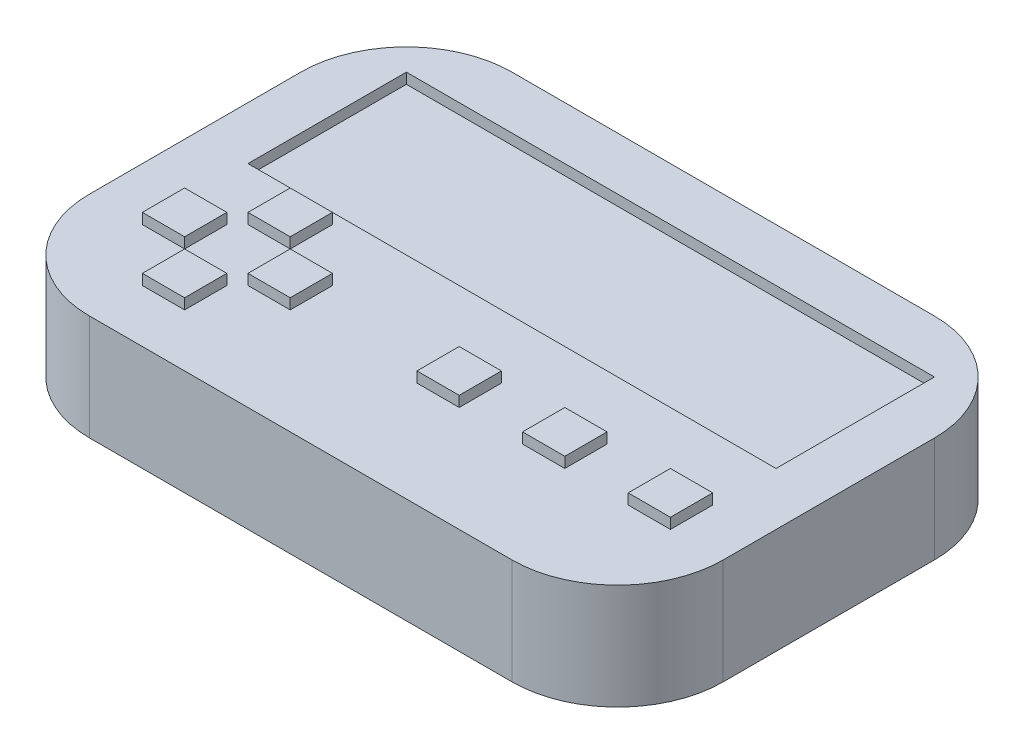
ISO-10303-21;
HEADER;
FILE_DESCRIPTION(('STEP AP214'),'2;1');
FILE_NAME('part.step','',(''),(''),'','','');
FILE_SCHEMA(('AUTOMOTIVE_DESIGN { 1 0 10303 214 1 1 1 1 }'));
ENDSEC;
DATA;
#1=APPLICATION_CONTEXT('core data for automotive mechanical design processes');
#2=APPLICATION_PROTOCOL_DEFINITION('international standard','automotive_design',2000,#1);
#3=PRODUCT_CONTEXT('',#1,'mechanical');
#4=PRODUCT('Part','Part','',(#3));
#5=PRODUCT_RELATED_PRODUCT_CATEGORY('part','',(#4));
#6=PRODUCT_DEFINITION_FORMATION('','',#4);
#7=PRODUCT_DEFINITION_CONTEXT('part definition',#1,'design');
#8=PRODUCT_DEFINITION('design','',#6,#7);
#9=PRODUCT_DEFINITION_SHAPE('','',#8);
#10=(LENGTH_UNIT() NAMED_UNIT(*) SI_UNIT(.MILLI.,.METRE.));
#11=(NAMED_UNIT(*) PLANE_ANGLE_UNIT() SI_UNIT($,.RADIAN.));
#12=(NAMED_UNIT(*) SI_UNIT($,.STERADIAN.) SOLID_ANGLE_UNIT());
#13=UNCERTAINTY_MEASURE_WITH_UNIT(LENGTH_MEASURE(1.E-05),#10,'distance_accuracy_value','');
#14=(GEOMETRIC_REPRESENTATION_CONTEXT(3) GLOBAL_UNCERTAINTY_ASSIGNED_CONTEXT((#13)) GLOBAL_UNIT_ASSIGNED_CONTEXT((#10,
#11,#12)) REPRESENTATION_CONTEXT('',''));
#15=CARTESIAN_POINT('',(0.,0.,0.));
#16=DIRECTION('',(0.,0.,1.));
#17=DIRECTION('',(1.,0.,0.));
#18=AXIS2_PLACEMENT_3D('',#15,#16,#17);
#19=CARTESIAN_POINT('',(0.,25.4,0.));
#20=DIRECTION('',(0.,1.,0.));
#21=DIRECTION('',(0.,0.,1.));
#22=AXIS2_PLACEMENT_3D('',#19,#20,#21);
#23=PLANE('',#22);
#24=DIRECTION('',(0.,0.,-1.));
#25=VECTOR('',#24,1.);
#26=CARTESIAN_POINT('',(63.5,25.4,0.));
#27=LINE('',#26,#25);
#28=CARTESIAN_POINT('',(63.5,25.4,0.));
#29=VERTEX_POINT('',#28);
#30=CARTESIAN_POINT('',(63.5,25.4,-38.1));
#31=VERTEX_POINT('',#30);
#32=EDGE_CURVE('E424',#29,#31,#27,.T.);
#33=ORIENTED_EDGE('',*,*,#32,.F.);
#34=DIRECTION('',(1.,0.,0.));
#35=VECTOR('',#34,1.);
#36=CARTESIAN_POINT('',(-63.5,25.4,0.));
#37=LINE('',#36,#35);
#38=CARTESIAN_POINT('',(-63.5,25.4,0.));
#39=VERTEX_POINT('',#38);
#40=EDGE_CURVE('E512',#39,#29,#37,.T.);
#41=ORIENTED_EDGE('',*,*,#40,.F.);
#42=DIRECTION('',(0.,0.,1.));
#43=VECTOR('',#42,1.);
#44=CARTESIAN_POINT('',(-63.5,25.4,0.));
#45=LINE('',#44,#43);
#46=CARTESIAN_POINT('',(-63.5,25.4,-38.1));
#47=VERTEX_POINT('',#46);
#48=EDGE_CURVE('E526',#47,#39,#45,.T.);
#49=ORIENTED_EDGE('',*,*,#48,.F.);
#50=DIRECTION('',(-1.,0.,0.));
#51=VECTOR('',#50,1.);
#52=CARTESIAN_POINT('',(-63.5,25.4,-38.1));
#53=LINE('',#52,#51);
#54=EDGE_CURVE('E523',#31,#47,#53,.T.);
#55=ORIENTED_EDGE('',*,*,#54,.F.);
#56=EDGE_LOOP('',(#33,#41,#49,#55));
#57=FACE_BOUND('',#56,.T.);
#58=DIRECTION('',(1.,0.,0.));
#59=VECTOR('',#58,1.);
#60=CARTESIAN_POINT('',(-76.2,25.4,50.8));
#61=LINE('',#60,#59);
#62=CARTESIAN_POINT('',(-50.8,25.4,50.8));
#63=VERTEX_POINT('',#62);
#64=CARTESIAN_POINT('',(50.8,25.4,50.8));
#65=VERTEX_POINT('',#64);
#66=EDGE_CURVE('E548',#63,#65,#61,.T.);
#67=ORIENTED_EDGE('',*,*,#66,.T.);
#68=CARTESIAN_POINT('',(50.8,25.4,25.4));
#69=DIRECTION('',(0.,1.,0.));
#70=DIRECTION('',(0.,0.,1.));
#71=AXIS2_PLACEMENT_3D('',#68,#69,#70);
#72=CIRCLE('',#71,25.4);
#73=CARTESIAN_POINT('',(76.2,25.4,25.4));
#74=VERTEX_POINT('',#73);
#75=EDGE_CURVE('E583',#65,#74,#72,.T.);
#76=ORIENTED_EDGE('',*,*,#75,.T.);
#77=DIRECTION('',(0.,0.,-1.));
#78=VECTOR('',#77,1.);
#79=CARTESIAN_POINT('',(76.2,25.4,-50.8));
#80=LINE('',#79,#78);
#81=CARTESIAN_POINT('',(76.2,25.4,-25.4));
#82=VERTEX_POINT('',#81);
#83=EDGE_CURVE('E540',#74,#82,#80,.T.);
#84=ORIENTED_EDGE('',*,*,#83,.T.);
#85=CARTESIAN_POINT('',(50.8,25.4,-25.4));
#86=DIRECTION('',(0.,1.,0.));
#87=DIRECTION('',(0.,0.,1.));
#88=AXIS2_PLACEMENT_3D('',#85,#86,#87);
#89=CIRCLE('',#88,25.4);
#90=CARTESIAN_POINT('',(50.7999999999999,25.4,-50.8));
#91=VERTEX_POINT('',#90);
#92=EDGE_CURVE('E581',#82,#91,#89,.T.);
#93=ORIENTED_EDGE('',*,*,#92,.T.);
#94=DIRECTION('',(-1.,0.,0.));
#95=VECTOR('',#94,1.);
#96=CARTESIAN_POINT('',(-76.2,25.4,-50.8));
#97=LINE('',#96,#95);
#98=CARTESIAN_POINT('',(-50.8,25.4,-50.8));
#99=VERTEX_POINT('',#98);
#100=EDGE_CURVE('E543',#91,#99,#97,.T.);
#101=ORIENTED_EDGE('',*,*,#100,.T.);
#102=CARTESIAN_POINT('',(-50.8,25.4,-25.4));
#103=DIRECTION('',(0.,1.,0.));
#104=DIRECTION('',(0.,0.,1.));
#105=AXIS2_PLACEMENT_3D('',#102,#103,#104);
#106=CIRCLE('',#105,25.4);
#107=CARTESIAN_POINT('',(-76.2,25.4,-25.4));
#108=VERTEX_POINT('',#107);
#109=EDGE_CURVE('E66',#99,#108,#106,.T.);
#110=ORIENTED_EDGE('',*,*,#109,.T.);
#111=DIRECTION('',(0.,0.,1.));
#112=VECTOR('',#111,1.);
#113=CARTESIAN_POINT('',(-76.2,25.4,-50.8));
#114=LINE('',#113,#112);
#115=CARTESIAN_POINT('',(-76.2,25.4,25.4));
#116=VERTEX_POINT('',#115);
#117=EDGE_CURVE('E546',#108,#116,#114,.T.);
#118=ORIENTED_EDGE('',*,*,#117,.T.);
#119=CARTESIAN_POINT('',(-50.8,25.4,25.4));
#120=DIRECTION('',(0.,1.,0.));
#121=DIRECTION('',(0.,0.,1.));
#122=AXIS2_PLACEMENT_3D('',#119,#120,#121);
#123=CIRCLE('',#122,25.4);
#124=EDGE_CURVE('E578',#116,#63,#123,.T.);
#125=ORIENTED_EDGE('',*,*,#124,.T.);
#126=EDGE_LOOP('',(#67,#76,#84,#93,#101,#110,#118,#125));
#127=FACE_BOUND('',#126,.T.);
#128=DIRECTION('',(-1.,0.,0.));
#129=VECTOR('',#128,1.);
#130=CARTESIAN_POINT('',(-63.5,25.4,15.24));
#131=LINE('',#130,#129);
#132=CARTESIAN_POINT('',(-53.34,25.4,15.24));
#133=VERTEX_POINT('',#132);
#134=CARTESIAN_POINT('',(-63.5,25.4,15.24));
#135=VERTEX_POINT('',#134);
#136=EDGE_CURVE('E497',#133,#135,#131,.T.);
#137=ORIENTED_EDGE('',*,*,#136,.F.);
#138=DIRECTION('',(0.,0.,-1.));
#139=VECTOR('',#138,1.);
#140=CARTESIAN_POINT('',(-53.34,25.4,15.24));
#141=LINE('',#140,#139);
#142=CARTESIAN_POINT('',(-53.34,25.4,25.4));
#143=VERTEX_POINT('',#142);
#144=EDGE_CURVE('E457',#143,#133,#141,.T.);
#145=ORIENTED_EDGE('',*,*,#144,.F.);
#146=DIRECTION('',(1.,0.,0.));
#147=VECTOR('',#146,1.);
#148=CARTESIAN_POINT('',(-63.5,25.4,25.4));
#149=LINE('',#148,#147);
#150=CARTESIAN_POINT('',(-63.5,25.4,25.4));
#151=VERTEX_POINT('',#150);
#152=EDGE_CURVE('E491',#151,#143,#149,.T.);
#153=ORIENTED_EDGE('',*,*,#152,.F.);
#154=DIRECTION('',(0.,0.,1.));
#155=VECTOR('',#154,1.);
#156=CARTESIAN_POINT('',(-63.5,25.4,15.24));
#157=LINE('',#156,#155);
#158=EDGE_CURVE('E493',#135,#151,#157,.T.);
#159=ORIENTED_EDGE('',*,*,#158,.F.);
#160=EDGE_LOOP('',(#137,#145,#153,#159));
#161=FACE_BOUND('',#160,.T.);
#162=DIRECTION('',(1.,0.,0.));
#163=VECTOR('',#162,1.);
#164=CARTESIAN_POINT('',(-27.94,25.4,25.4));
#165=LINE('',#164,#163);
#166=CARTESIAN_POINT('',(-38.1,25.4,25.4));
#167=VERTEX_POINT('',#166);
#168=CARTESIAN_POINT('',(-27.94,25.4,25.4));
#169=VERTEX_POINT('',#168);
#170=EDGE_CURVE('E472',#167,#169,#165,.T.);
#171=ORIENTED_EDGE('',*,*,#170,.F.);
#172=DIRECTION('',(0.,0.,1.));
#173=VECTOR('',#172,1.);
#174=CARTESIAN_POINT('',(-38.1,25.4,25.4));
#175=LINE('',#174,#173);
#176=CARTESIAN_POINT('',(-38.1,25.4,15.24));
#177=VERTEX_POINT('',#176);
#178=EDGE_CURVE('E428',#177,#167,#175,.T.);
#179=ORIENTED_EDGE('',*,*,#178,.F.);
#180=DIRECTION('',(-1.,0.,0.));
#181=VECTOR('',#180,1.);
#182=CARTESIAN_POINT('',(-27.94,25.4,15.24));
#183=LINE('',#182,#181);
#184=CARTESIAN_POINT('',(-27.94,25.4,15.24));
#185=VERTEX_POINT('',#184);
#186=EDGE_CURVE('E466',#185,#177,#183,.T.);
#187=ORIENTED_EDGE('',*,*,#186,.F.);
#188=DIRECTION('',(0.,0.,-1.));
#189=VECTOR('',#188,1.);
#190=CARTESIAN_POINT('',(-27.94,25.4,25.4));
#191=LINE('',#190,#189);
#192=EDGE_CURVE('E468',#169,#185,#191,.T.);
#193=ORIENTED_EDGE('',*,*,#192,.F.);
#194=EDGE_LOOP('',(#171,#179,#187,#193));
#195=FACE_BOUND('',#194,.T.);
#196=DIRECTION('',(-1.,0.,0.));
#197=VECTOR('',#196,1.);
#198=CARTESIAN_POINT('',(-50.8,25.4,27.94));
#199=LINE('',#198,#197);
#200=CARTESIAN_POINT('',(-40.64,25.4,27.94));
#201=VERTEX_POINT('',#200);
#202=CARTESIAN_POINT('',(-50.8,25.4,27.94));
#203=VERTEX_POINT('',#202);
#204=EDGE_CURVE('E443',#201,#203,#199,.T.);
#205=ORIENTED_EDGE('',*,*,#204,.F.);
#206=DIRECTION('',(0.,0.,-1.));
#207=VECTOR('',#206,1.);
#208=CARTESIAN_POINT('',(-40.64,25.4,38.1));
#209=LINE('',#208,#207);
#210=CARTESIAN_POINT('',(-40.64,25.4,38.1));
#211=VERTEX_POINT('',#210);
#212=EDGE_CURVE('E409',#211,#201,#209,.T.);
#213=ORIENTED_EDGE('',*,*,#212,.F.);
#214=DIRECTION('',(1.,0.,0.));
#215=VECTOR('',#214,1.);
#216=CARTESIAN_POINT('',(-50.8,25.4,38.1));
#217=LINE('',#216,#215);
#218=CARTESIAN_POINT('',(-50.8,25.4,38.1));
#219=VERTEX_POINT('',#218);
#220=EDGE_CURVE('E437',#219,#211,#217,.T.);
#221=ORIENTED_EDGE('',*,*,#220,.F.);
#222=DIRECTION('',(0.,0.,1.));
#223=VECTOR('',#222,1.);
#224=CARTESIAN_POINT('',(-50.8,25.4,38.1));
#225=LINE('',#224,#223);
#226=EDGE_CURVE('E439',#203,#219,#225,.T.);
#227=ORIENTED_EDGE('',*,*,#226,.F.);
#228=EDGE_LOOP('',(#205,#213,#221,#227));
#229=FACE_BOUND('',#228,.T.);
#230=DIRECTION('',(-1.,0.,0.));
#231=VECTOR('',#230,1.);
#232=CARTESIAN_POINT('',(-50.8,25.4,2.53999999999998));
#233=LINE('',#232,#231);
#234=CARTESIAN_POINT('',(-40.64,25.4,2.53999999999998));
#235=VERTEX_POINT('',#234);
#236=CARTESIAN_POINT('',(-50.8,25.4,2.53999999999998));
#237=VERTEX_POINT('',#236);
#238=EDGE_CURVE('E408',#235,#237,#233,.T.);
#239=ORIENTED_EDGE('',*,*,#238,.F.);
#240=DIRECTION('',(0.,0.,-1.));
#241=VECTOR('',#240,1.);
#242=CARTESIAN_POINT('',(-40.64,25.4,2.53999999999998));
#243=LINE('',#242,#241);
#244=CARTESIAN_POINT('',(-40.64,25.4,12.7));
#245=VERTEX_POINT('',#244);
#246=EDGE_CURVE('E405',#245,#235,#243,.T.);
#247=ORIENTED_EDGE('',*,*,#246,.F.);
#248=DIRECTION('',(1.,0.,0.));
#249=VECTOR('',#248,1.);
#250=CARTESIAN_POINT('',(-50.8,25.4,12.7));
#251=LINE('',#250,#249);
#252=CARTESIAN_POINT('',(-50.8,25.4,12.7));
#253=VERTEX_POINT('',#252);
#254=EDGE_CURVE('E398',#253,#245,#251,.T.);
#255=ORIENTED_EDGE('',*,*,#254,.F.);
#256=DIRECTION('',(0.,0.,1.));
#257=VECTOR('',#256,1.);
#258=CARTESIAN_POINT('',(-50.8,25.4,2.53999999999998));
#259=LINE('',#258,#257);
#260=EDGE_CURVE('E411',#237,#253,#259,.T.);
#261=ORIENTED_EDGE('',*,*,#260,.F.);
#262=EDGE_LOOP('',(#239,#247,#255,#261));
#263=FACE_BOUND('',#262,.T.);
#264=DIRECTION('',(-1.,0.,0.));
#265=VECTOR('',#264,1.);
#266=CARTESIAN_POINT('',(53.34,25.4,15.24));
#267=LINE('',#266,#265);
#268=CARTESIAN_POINT('',(63.5,25.4,15.24));
#269=VERTEX_POINT('',#268);
#270=CARTESIAN_POINT('',(53.34,25.4,15.24));
#271=VERTEX_POINT('',#270);
#272=EDGE_CURVE('E383',#269,#271,#267,.T.);
#273=ORIENTED_EDGE('',*,*,#272,.F.);
#274=DIRECTION('',(0.,0.,-1.));
#275=VECTOR('',#274,1.);
#276=CARTESIAN_POINT('',(63.5,25.4,15.24));
#277=LINE('',#276,#275);
#278=CARTESIAN_POINT('',(63.5,25.4,25.4));
#279=VERTEX_POINT('',#278);
#280=EDGE_CURVE('E339',#279,#269,#277,.T.);
#281=ORIENTED_EDGE('',*,*,#280,.F.);
#282=DIRECTION('',(1.,0.,0.));
#283=VECTOR('',#282,1.);
#284=CARTESIAN_POINT('',(53.34,25.4,25.4));
#285=LINE('',#284,#283);
#286=CARTESIAN_POINT('',(53.34,25.4,25.4));
#287=VERTEX_POINT('',#286);
#288=EDGE_CURVE('E377',#287,#279,#285,.T.);
#289=ORIENTED_EDGE('',*,*,#288,.F.);
#290=DIRECTION('',(0.,0.,1.));
#291=VECTOR('',#290,1.);
#292=CARTESIAN_POINT('',(53.34,25.4,15.24));
#293=LINE('',#292,#291);
#294=EDGE_CURVE('E379',#271,#287,#293,.T.);
#295=ORIENTED_EDGE('',*,*,#294,.F.);
#296=EDGE_LOOP('',(#273,#281,#289,#295));
#297=FACE_BOUND('',#296,.T.);
#298=DIRECTION('',(-1.,0.,0.));
#299=VECTOR('',#298,1.);
#300=CARTESIAN_POINT('',(27.94,25.4,15.24));
#301=LINE('',#300,#299);
#302=CARTESIAN_POINT('',(38.1,25.4,15.24));
#303=VERTEX_POINT('',#302);
#304=CARTESIAN_POINT('',(27.94,25.4,15.24));
#305=VERTEX_POINT('',#304);
#306=EDGE_CURVE('E354',#303,#305,#301,.T.);
#307=ORIENTED_EDGE('',*,*,#306,.F.);
#308=DIRECTION('',(0.,0.,-1.));
#309=VECTOR('',#308,1.);
#310=CARTESIAN_POINT('',(38.1,25.4,15.24));
#311=LINE('',#310,#309);
#312=CARTESIAN_POINT('',(38.1,25.4,25.4));
#313=VERTEX_POINT('',#312);
#314=EDGE_CURVE('E356',#313,#303,#311,.T.);
#315=ORIENTED_EDGE('',*,*,#314,.F.);
#316=DIRECTION('',(1.,0.,0.));
#317=VECTOR('',#316,1.);
#318=CARTESIAN_POINT('',(27.94,25.4,25.4));
#319=LINE('',#318,#317);
#320=CARTESIAN_POINT('',(27.94,25.4,25.4));
#321=VERTEX_POINT('',#320);
#322=EDGE_CURVE('E348',#321,#313,#319,.T.);
#323=ORIENTED_EDGE('',*,*,#322,.F.);
#324=DIRECTION('',(0.,0.,1.));
#325=VECTOR('',#324,1.);
#326=CARTESIAN_POINT('',(27.94,25.4,15.24));
#327=LINE('',#326,#325);
#328=EDGE_CURVE('E350',#305,#321,#327,.T.);
#329=ORIENTED_EDGE('',*,*,#328,.F.);
#330=EDGE_LOOP('',(#307,#315,#323,#329));
#331=FACE_BOUND('',#330,.T.);
#332=DIRECTION('',(-1.,0.,0.));
#333=VECTOR('',#332,1.);
#334=CARTESIAN_POINT('',(2.54000000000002,25.4,15.24));
#335=LINE('',#334,#333);
#336=CARTESIAN_POINT('',(12.7,25.4,15.24));
#337=VERTEX_POINT('',#336);
#338=CARTESIAN_POINT('',(2.54000000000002,25.4,15.24));
#339=VERTEX_POINT('',#338);
#340=EDGE_CURVE('E1297',#337,#339,#335,.T.);
#341=ORIENTED_EDGE('',*,*,#340,.F.);
#342=DIRECTION('',(0.,0.,-1.));
#343=VECTOR('',#342,1.);
#344=CARTESIAN_POINT('',(12.7,25.4,15.24));
#345=LINE('',#344,#343);
#346=CARTESIAN_POINT('',(12.7,25.4,25.4));
#347=VERTEX_POINT('',#346);
#348=EDGE_CURVE('E326',#347,#337,#345,.T.);
#349=ORIENTED_EDGE('',*,*,#348,.F.);
#350=DIRECTION('',(1.,0.,0.));
#351=VECTOR('',#350,1.);
#352=CARTESIAN_POINT('',(2.54000000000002,25.4,25.4));
#353=LINE('',#352,#351);
#354=CARTESIAN_POINT('',(2.54000000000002,25.4,25.4));
#355=VERTEX_POINT('',#354);
#356=EDGE_CURVE('E322',#355,#347,#353,.T.);
#357=ORIENTED_EDGE('',*,*,#356,.F.);
#358=DIRECTION('',(0.,0.,1.));
#359=VECTOR('',#358,1.);
#360=CARTESIAN_POINT('',(2.54000000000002,25.4,15.24));
#361=LINE('',#360,#359);
#362=EDGE_CURVE('E1300',#339,#355,#361,.T.);
#363=ORIENTED_EDGE('',*,*,#362,.F.);
#364=EDGE_LOOP('',(#341,#349,#357,#363));
#365=FACE_BOUND('',#364,.T.);
#366=ADVANCED_FACE('F45',(#57,#127,#161,#195,#229,#263,#297,#331,#365),#23,.T.);
#367=CARTESIAN_POINT('',(76.2,25.4,-50.8));
#368=DIRECTION('',(-1.,0.,0.));
#369=DIRECTION('',(0.,0.,1.));
#370=AXIS2_PLACEMENT_3D('',#367,#368,#369);
#371=PLANE('',#370);
#372=ORIENTED_EDGE('',*,*,#83,.F.);
#373=DIRECTION('',(0.,-1.,0.));
#374=VECTOR('',#373,1.);
#375=CARTESIAN_POINT('',(76.2,25.4,25.4));
#376=LINE('',#375,#374);
#377=CARTESIAN_POINT('',(76.2,0.,25.4));
#378=VERTEX_POINT('',#377);
#379=EDGE_CURVE('E562',#74,#378,#376,.T.);
#380=ORIENTED_EDGE('',*,*,#379,.T.);
#381=DIRECTION('',(0.,0.,-1.));
#382=VECTOR('',#381,1.);
#383=CARTESIAN_POINT('',(76.2,0.,-50.8));
#384=LINE('',#383,#382);
#385=CARTESIAN_POINT('',(76.2,0.,-25.4));
#386=VERTEX_POINT('',#385);
#387=EDGE_CURVE('E533',#378,#386,#384,.T.);
#388=ORIENTED_EDGE('',*,*,#387,.T.);
#389=DIRECTION('',(0.,-1.,0.));
#390=VECTOR('',#389,1.);
#391=CARTESIAN_POINT('',(76.2,25.4,-25.4));
#392=LINE('',#391,#390);
#393=EDGE_CURVE('E551',#386,#82,#392,.F.);
#394=ORIENTED_EDGE('',*,*,#393,.T.);
#395=EDGE_LOOP('',(#372,#380,#388,#394));
#396=FACE_BOUND('',#395,.T.);
#397=ADVANCED_FACE('F620',(#396),#371,.F.);
#398=CARTESIAN_POINT('',(-76.2,25.4,-50.8));
#399=DIRECTION('',(0.,0.,1.));
#400=DIRECTION('',(1.,0.,0.));
#401=AXIS2_PLACEMENT_3D('',#398,#399,#400);
#402=PLANE('',#401);
#403=ORIENTED_EDGE('',*,*,#100,.F.);
#404=DIRECTION('',(0.,-1.,0.));
#405=VECTOR('',#404,1.);
#406=CARTESIAN_POINT('',(50.8,25.4,-50.8));
#407=LINE('',#406,#405);
#408=CARTESIAN_POINT('',(50.7999999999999,0.,-50.8));
#409=VERTEX_POINT('',#408);
#410=EDGE_CURVE('E587',#91,#409,#407,.T.);
#411=ORIENTED_EDGE('',*,*,#410,.T.);
#412=DIRECTION('',(-1.,0.,0.));
#413=VECTOR('',#412,1.);
#414=CARTESIAN_POINT('',(-76.2,0.,-50.8));
#415=LINE('',#414,#413);
#416=CARTESIAN_POINT('',(-50.8,0.,-50.8));
#417=VERTEX_POINT('',#416);
#418=EDGE_CURVE('E554',#409,#417,#415,.T.);
#419=ORIENTED_EDGE('',*,*,#418,.T.);
#420=DIRECTION('',(0.,-1.,0.));
#421=VECTOR('',#420,1.);
#422=CARTESIAN_POINT('',(-50.8,25.4,-50.8));
#423=LINE('',#422,#421);
#424=EDGE_CURVE('E585',#417,#99,#423,.F.);
#425=ORIENTED_EDGE('',*,*,#424,.T.);
#426=EDGE_LOOP('',(#403,#411,#419,#425));
#427=FACE_BOUND('',#426,.T.);
#428=ADVANCED_FACE('F593',(#427),#402,.F.);
#429=CARTESIAN_POINT('',(-76.2,25.4,-50.8));
#430=DIRECTION('',(1.,0.,0.));
#431=DIRECTION('',(0.,0.,-1.));
#432=AXIS2_PLACEMENT_3D('',#429,#430,#431);
#433=PLANE('',#432);
#434=ORIENTED_EDGE('',*,*,#117,.F.);
#435=DIRECTION('',(0.,-1.,0.));
#436=VECTOR('',#435,1.);
#437=CARTESIAN_POINT('',(-76.2,25.4,-25.4));
#438=LINE('',#437,#436);
#439=CARTESIAN_POINT('',(-76.2,0.,-25.4));
#440=VERTEX_POINT('',#439);
#441=EDGE_CURVE('E11',#108,#440,#438,.T.);
#442=ORIENTED_EDGE('',*,*,#441,.T.);
#443=DIRECTION('',(0.,0.,1.));
#444=VECTOR('',#443,1.);
#445=CARTESIAN_POINT('',(-76.2,0.,-50.8));
#446=LINE('',#445,#444);
#447=CARTESIAN_POINT('',(-76.2,0.,25.4));
#448=VERTEX_POINT('',#447);
#449=EDGE_CURVE('E557',#440,#448,#446,.T.);
#450=ORIENTED_EDGE('',*,*,#449,.T.);
#451=DIRECTION('',(0.,-1.,0.));
#452=VECTOR('',#451,1.);
#453=CARTESIAN_POINT('',(-76.2,25.4,25.4));
#454=LINE('',#453,#452);
#455=EDGE_CURVE('E53',#448,#116,#454,.F.);
#456=ORIENTED_EDGE('',*,*,#455,.T.);
#457=EDGE_LOOP('',(#434,#442,#450,#456));
#458=FACE_BOUND('',#457,.T.);
#459=ADVANCED_FACE('F604',(#458),#433,.F.);
#460=CARTESIAN_POINT('',(-76.2,25.4,50.8));
#461=DIRECTION('',(0.,0.,-1.));
#462=DIRECTION('',(-1.,0.,0.));
#463=AXIS2_PLACEMENT_3D('',#460,#461,#462);
#464=PLANE('',#463);
#465=DIRECTION('',(1.,0.,0.));
#466=VECTOR('',#465,1.);
#467=CARTESIAN_POINT('',(-76.2,0.,50.8));
#468=LINE('',#467,#466);
#469=CARTESIAN_POINT('',(-50.8,0.,50.8));
#470=VERTEX_POINT('',#469);
#471=CARTESIAN_POINT('',(50.8,0.,50.8));
#472=VERTEX_POINT('',#471);
#473=EDGE_CURVE('E544',#470,#472,#468,.T.);
#474=ORIENTED_EDGE('',*,*,#473,.T.);
#475=DIRECTION('',(0.,-1.,0.));
#476=VECTOR('',#475,1.);
#477=CARTESIAN_POINT('',(50.8,25.4,50.8));
#478=LINE('',#477,#476);
#479=EDGE_CURVE('E576',#472,#65,#478,.F.);
#480=ORIENTED_EDGE('',*,*,#479,.T.);
#481=ORIENTED_EDGE('',*,*,#66,.F.);
#482=DIRECTION('',(0.,-1.,0.));
#483=VECTOR('',#482,1.);
#484=CARTESIAN_POINT('',(-50.8,25.4,50.8));
#485=LINE('',#484,#483);
#486=EDGE_CURVE('E573',#63,#470,#485,.T.);
#487=ORIENTED_EDGE('',*,*,#486,.T.);
#488=EDGE_LOOP('',(#474,#480,#481,#487));
#489=FACE_BOUND('',#488,.T.);
#490=ADVANCED_FACE('F612',(#489),#464,.F.);
#491=CARTESIAN_POINT('',(0.,0.,0.));
#492=DIRECTION('',(0.,1.,0.));
#493=DIRECTION('',(0.,0.,1.));
#494=AXIS2_PLACEMENT_3D('',#491,#492,#493);
#495=PLANE('',#494);
#496=ORIENTED_EDGE('',*,*,#387,.F.);
#497=CARTESIAN_POINT('',(50.8,0.,25.4));
#498=DIRECTION('',(0.,1.,0.));
#499=DIRECTION('',(0.,0.,1.));
#500=AXIS2_PLACEMENT_3D('',#497,#498,#499);
#501=CIRCLE('',#500,25.4);
#502=EDGE_CURVE('E571',#378,#472,#501,.F.);
#503=ORIENTED_EDGE('',*,*,#502,.T.);
#504=ORIENTED_EDGE('',*,*,#473,.F.);
#505=CARTESIAN_POINT('',(-50.8,0.,25.4));
#506=DIRECTION('',(0.,1.,0.));
#507=DIRECTION('',(0.,0.,1.));
#508=AXIS2_PLACEMENT_3D('',#505,#506,#507);
#509=CIRCLE('',#508,25.4);
#510=EDGE_CURVE('E565',#470,#448,#509,.F.);
#511=ORIENTED_EDGE('',*,*,#510,.T.);
#512=ORIENTED_EDGE('',*,*,#449,.F.);
#513=CARTESIAN_POINT('',(-50.8,0.,-25.4));
#514=DIRECTION('',(0.,1.,0.));
#515=DIRECTION('',(0.,0.,1.));
#516=AXIS2_PLACEMENT_3D('',#513,#514,#515);
#517=CIRCLE('',#516,25.4);
#518=EDGE_CURVE('E567',#440,#417,#517,.F.);
#519=ORIENTED_EDGE('',*,*,#518,.T.);
#520=ORIENTED_EDGE('',*,*,#418,.F.);
#521=CARTESIAN_POINT('',(50.8,0.,-25.4));
#522=DIRECTION('',(0.,1.,0.));
#523=DIRECTION('',(0.,0.,1.));
#524=AXIS2_PLACEMENT_3D('',#521,#522,#523);
#525=CIRCLE('',#524,25.4);
#526=EDGE_CURVE('E569',#409,#386,#525,.F.);
#527=ORIENTED_EDGE('',*,*,#526,.T.);
#528=EDGE_LOOP('',(#496,#503,#504,#511,#512,#519,#520,#527));
#529=FACE_BOUND('',#528,.T.);
#530=ADVANCED_FACE('F599',(#529),#495,.F.);
#531=CARTESIAN_POINT('',(63.5,22.86,0.));
#532=DIRECTION('',(1.,0.,0.));
#533=DIRECTION('',(0.,0.,-1.));
#534=AXIS2_PLACEMENT_3D('',#531,#532,#533);
#535=PLANE('',#534);
#536=ORIENTED_EDGE('',*,*,#32,.T.);
#537=DIRECTION('',(0.,1.,0.));
#538=VECTOR('',#537,1.);
#539=CARTESIAN_POINT('',(63.5,22.86,-38.1));
#540=LINE('',#539,#538);
#541=CARTESIAN_POINT('',(63.5,22.86,-38.1));
#542=VERTEX_POINT('',#541);
#543=EDGE_CURVE('E521',#542,#31,#540,.T.);
#544=ORIENTED_EDGE('',*,*,#543,.F.);
#545=DIRECTION('',(0.,0.,-1.));
#546=VECTOR('',#545,1.);
#547=CARTESIAN_POINT('',(63.5,22.86,0.));
#548=LINE('',#547,#546);
#549=CARTESIAN_POINT('',(63.5,22.86,0.));
#550=VERTEX_POINT('',#549);
#551=EDGE_CURVE('E508',#550,#542,#548,.T.);
#552=ORIENTED_EDGE('',*,*,#551,.F.);
#553=DIRECTION('',(0.,1.,0.));
#554=VECTOR('',#553,1.);
#555=CARTESIAN_POINT('',(63.5,22.86,0.));
#556=LINE('',#555,#554);
#557=EDGE_CURVE('E531',#550,#29,#556,.T.);
#558=ORIENTED_EDGE('',*,*,#557,.T.);
#559=EDGE_LOOP('',(#536,#544,#552,#558));
#560=FACE_BOUND('',#559,.T.);
#561=ADVANCED_FACE('F641',(#560),#535,.F.);
#562=CARTESIAN_POINT('',(-63.5,22.86,0.));
#563=DIRECTION('',(0.,0.,1.));
#564=DIRECTION('',(1.,0.,0.));
#565=AXIS2_PLACEMENT_3D('',#562,#563,#564);
#566=PLANE('',#565);
#567=ORIENTED_EDGE('',*,*,#40,.T.);
#568=ORIENTED_EDGE('',*,*,#557,.F.);
#569=DIRECTION('',(1.,0.,0.));
#570=VECTOR('',#569,1.);
#571=CARTESIAN_POINT('',(-63.5,22.86,0.));
#572=LINE('',#571,#570);
#573=CARTESIAN_POINT('',(-63.5,22.86,0.));
#574=VERTEX_POINT('',#573);
#575=EDGE_CURVE('E518',#574,#550,#572,.T.);
#576=ORIENTED_EDGE('',*,*,#575,.F.);
#577=DIRECTION('',(0.,1.,0.));
#578=VECTOR('',#577,1.);
#579=CARTESIAN_POINT('',(-63.5,22.86,0.));
#580=LINE('',#579,#578);
#581=EDGE_CURVE('E534',#574,#39,#580,.T.);
#582=ORIENTED_EDGE('',*,*,#581,.T.);
#583=EDGE_LOOP('',(#567,#568,#576,#582));
#584=FACE_BOUND('',#583,.T.);
#585=ADVANCED_FACE('F1144',(#584),#566,.F.);
#586=CARTESIAN_POINT('',(-63.5,22.86,0.));
#587=DIRECTION('',(-1.,0.,0.));
#588=DIRECTION('',(0.,0.,1.));
#589=AXIS2_PLACEMENT_3D('',#586,#587,#588);
#590=PLANE('',#589);
#591=ORIENTED_EDGE('',*,*,#48,.T.);
#592=ORIENTED_EDGE('',*,*,#581,.F.);
#593=DIRECTION('',(0.,0.,1.));
#594=VECTOR('',#593,1.);
#595=CARTESIAN_POINT('',(-63.5,22.86,0.));
#596=LINE('',#595,#594);
#597=CARTESIAN_POINT('',(-63.5,22.86,-38.1));
#598=VERTEX_POINT('',#597);
#599=EDGE_CURVE('E515',#598,#574,#596,.T.);
#600=ORIENTED_EDGE('',*,*,#599,.F.);
#601=DIRECTION('',(0.,1.,0.));
#602=VECTOR('',#601,1.);
#603=CARTESIAN_POINT('',(-63.5,22.86,-38.1));
#604=LINE('',#603,#602);
#605=EDGE_CURVE('E536',#598,#47,#604,.T.);
#606=ORIENTED_EDGE('',*,*,#605,.T.);
#607=EDGE_LOOP('',(#591,#592,#600,#606));
#608=FACE_BOUND('',#607,.T.);
#609=ADVANCED_FACE('F1133',(#608),#590,.F.);
#610=CARTESIAN_POINT('',(-63.5,22.86,-38.1));
#611=DIRECTION('',(0.,0.,-1.));
#612=DIRECTION('',(-1.,0.,0.));
#613=AXIS2_PLACEMENT_3D('',#610,#611,#612);
#614=PLANE('',#613);
#615=ORIENTED_EDGE('',*,*,#54,.T.);
#616=ORIENTED_EDGE('',*,*,#605,.F.);
#617=DIRECTION('',(-1.,0.,0.));
#618=VECTOR('',#617,1.);
#619=CARTESIAN_POINT('',(-63.5,22.86,-38.1));
#620=LINE('',#619,#618);
#621=EDGE_CURVE('E511',#542,#598,#620,.T.);
#622=ORIENTED_EDGE('',*,*,#621,.F.);
#623=ORIENTED_EDGE('',*,*,#543,.T.);
#624=EDGE_LOOP('',(#615,#616,#622,#623));
#625=FACE_BOUND('',#624,.T.);
#626=ADVANCED_FACE('F1121',(#625),#614,.F.);
#627=CARTESIAN_POINT('',(0.,22.86,0.));
#628=DIRECTION('',(0.,-1.,0.));
#629=DIRECTION('',(0.,0.,-1.));
#630=AXIS2_PLACEMENT_3D('',#627,#628,#629);
#631=PLANE('',#630);
#632=ORIENTED_EDGE('',*,*,#551,.T.);
#633=ORIENTED_EDGE('',*,*,#621,.T.);
#634=ORIENTED_EDGE('',*,*,#599,.T.);
#635=ORIENTED_EDGE('',*,*,#575,.T.);
#636=EDGE_LOOP('',(#632,#633,#634,#635));
#637=FACE_BOUND('',#636,.T.);
#638=ADVANCED_FACE('F1109',(#637),#631,.F.);
#639=CARTESIAN_POINT('',(-53.34,27.94,15.24));
#640=DIRECTION('',(-1.,0.,0.));
#641=DIRECTION('',(0.,0.,1.));
#642=AXIS2_PLACEMENT_3D('',#639,#640,#641);
#643=PLANE('',#642);
#644=ORIENTED_EDGE('',*,*,#144,.T.);
#645=DIRECTION('',(0.,-1.,0.));
#646=VECTOR('',#645,1.);
#647=CARTESIAN_POINT('',(-53.34,27.94,15.24));
#648=LINE('',#647,#646);
#649=CARTESIAN_POINT('',(-53.34,27.94,15.24));
#650=VERTEX_POINT('',#649);
#651=EDGE_CURVE('E328',#650,#133,#648,.T.);
#652=ORIENTED_EDGE('',*,*,#651,.F.);
#653=DIRECTION('',(0.,0.,-1.));
#654=VECTOR('',#653,1.);
#655=CARTESIAN_POINT('',(-53.34,27.94,15.24));
#656=LINE('',#655,#654);
#657=CARTESIAN_POINT('',(-53.34,27.94,25.4));
#658=VERTEX_POINT('',#657);
#659=EDGE_CURVE('E494',#658,#650,#656,.T.);
#660=ORIENTED_EDGE('',*,*,#659,.F.);
#661=DIRECTION('',(0.,-1.,0.));
#662=VECTOR('',#661,1.);
#663=CARTESIAN_POINT('',(-53.34,27.94,25.4));
#664=LINE('',#663,#662);
#665=EDGE_CURVE('E487',#658,#143,#664,.T.);
#666=ORIENTED_EDGE('',*,*,#665,.T.);
#667=EDGE_LOOP('',(#644,#652,#660,#666));
#668=FACE_BOUND('',#667,.T.);
#669=ADVANCED_FACE('F1097',(#668),#643,.F.);
#670=CARTESIAN_POINT('',(-63.5,27.94,15.24));
#671=DIRECTION('',(0.,0.,1.));
#672=DIRECTION('',(1.,0.,0.));
#673=AXIS2_PLACEMENT_3D('',#670,#671,#672);
#674=PLANE('',#673);
#675=ORIENTED_EDGE('',*,*,#136,.T.);
#676=DIRECTION('',(0.,-1.,0.));
#677=VECTOR('',#676,1.);
#678=CARTESIAN_POINT('',(-63.5,27.94,15.24));
#679=LINE('',#678,#677);
#680=CARTESIAN_POINT('',(-63.5,27.94,15.24));
#681=VERTEX_POINT('',#680);
#682=EDGE_CURVE('E330',#681,#135,#679,.T.);
#683=ORIENTED_EDGE('',*,*,#682,.F.);
#684=DIRECTION('',(-1.,0.,0.));
#685=VECTOR('',#684,1.);
#686=CARTESIAN_POINT('',(-63.5,27.94,15.24));
#687=LINE('',#686,#685);
#688=EDGE_CURVE('E504',#650,#681,#687,.T.);
#689=ORIENTED_EDGE('',*,*,#688,.F.);
#690=ORIENTED_EDGE('',*,*,#651,.T.);
#691=EDGE_LOOP('',(#675,#683,#689,#690));
#692=FACE_BOUND('',#691,.T.);
#693=ADVANCED_FACE('F1085',(#692),#674,.F.);
#694=CARTESIAN_POINT('',(-63.5,27.94,15.24));
#695=DIRECTION('',(1.,0.,0.));
#696=DIRECTION('',(0.,0.,-1.));
#697=AXIS2_PLACEMENT_3D('',#694,#695,#696);
#698=PLANE('',#697);
#699=ORIENTED_EDGE('',*,*,#158,.T.);
#700=DIRECTION('',(0.,-1.,0.));
#701=VECTOR('',#700,1.);
#702=CARTESIAN_POINT('',(-63.5,27.94,25.4));
#703=LINE('',#702,#701);
#704=CARTESIAN_POINT('',(-63.5,27.94,25.4));
#705=VERTEX_POINT('',#704);
#706=EDGE_CURVE('E485',#705,#151,#703,.T.);
#707=ORIENTED_EDGE('',*,*,#706,.F.);
#708=DIRECTION('',(0.,0.,1.));
#709=VECTOR('',#708,1.);
#710=CARTESIAN_POINT('',(-63.5,27.94,15.24));
#711=LINE('',#710,#709);
#712=EDGE_CURVE('E502',#681,#705,#711,.T.);
#713=ORIENTED_EDGE('',*,*,#712,.F.);
#714=ORIENTED_EDGE('',*,*,#682,.T.);
#715=EDGE_LOOP('',(#699,#707,#713,#714));
#716=FACE_BOUND('',#715,.T.);
#717=ADVANCED_FACE('F1073',(#716),#698,.F.);
#718=CARTESIAN_POINT('',(-63.5,27.94,25.4));
#719=DIRECTION('',(0.,0.,-1.));
#720=DIRECTION('',(-1.,0.,0.));
#721=AXIS2_PLACEMENT_3D('',#718,#719,#720);
#722=PLANE('',#721);
#723=ORIENTED_EDGE('',*,*,#152,.T.);
#724=ORIENTED_EDGE('',*,*,#665,.F.);
#725=DIRECTION('',(1.,0.,0.));
#726=VECTOR('',#725,1.);
#727=CARTESIAN_POINT('',(-63.5,27.94,25.4));
#728=LINE('',#727,#726);
#729=EDGE_CURVE('E490',#705,#658,#728,.T.);
#730=ORIENTED_EDGE('',*,*,#729,.F.);
#731=ORIENTED_EDGE('',*,*,#706,.T.);
#732=EDGE_LOOP('',(#723,#724,#730,#731));
#733=FACE_BOUND('',#732,.T.);
#734=ADVANCED_FACE('F1061',(#733),#722,.F.);
#735=CARTESIAN_POINT('',(0.,27.94,0.));
#736=DIRECTION('',(0.,1.,0.));
#737=DIRECTION('',(0.,0.,1.));
#738=AXIS2_PLACEMENT_3D('',#735,#736,#737);
#739=PLANE('',#738);
#740=ORIENTED_EDGE('',*,*,#659,.T.);
#741=ORIENTED_EDGE('',*,*,#688,.T.);
#742=ORIENTED_EDGE('',*,*,#712,.T.);
#743=ORIENTED_EDGE('',*,*,#729,.T.);
#744=EDGE_LOOP('',(#740,#741,#742,#743));
#745=FACE_BOUND('',#744,.T.);
#746=ADVANCED_FACE('F1049',(#745),#739,.T.);
#747=CARTESIAN_POINT('',(-38.1,27.94,25.4));
#748=DIRECTION('',(1.,0.,0.));
#749=DIRECTION('',(0.,0.,-1.));
#750=AXIS2_PLACEMENT_3D('',#747,#748,#749);
#751=PLANE('',#750);
#752=ORIENTED_EDGE('',*,*,#178,.T.);
#753=DIRECTION('',(0.,-1.,0.));
#754=VECTOR('',#753,1.);
#755=CARTESIAN_POINT('',(-38.1,27.94,25.4));
#756=LINE('',#755,#754);
#757=CARTESIAN_POINT('',(-38.1,27.94,25.4));
#758=VERTEX_POINT('',#757);
#759=EDGE_CURVE('E454',#758,#167,#756,.T.);
#760=ORIENTED_EDGE('',*,*,#759,.F.);
#761=DIRECTION('',(0.,0.,1.));
#762=VECTOR('',#761,1.);
#763=CARTESIAN_POINT('',(-38.1,27.94,25.4));
#764=LINE('',#763,#762);
#765=CARTESIAN_POINT('',(-38.1,27.94,15.24));
#766=VERTEX_POINT('',#765);
#767=EDGE_CURVE('E469',#766,#758,#764,.T.);
#768=ORIENTED_EDGE('',*,*,#767,.F.);
#769=DIRECTION('',(0.,-1.,0.));
#770=VECTOR('',#769,1.);
#771=CARTESIAN_POINT('',(-38.1,27.94,15.24));
#772=LINE('',#771,#770);
#773=EDGE_CURVE('E462',#766,#177,#772,.T.);
#774=ORIENTED_EDGE('',*,*,#773,.T.);
#775=EDGE_LOOP('',(#752,#760,#768,#774));
#776=FACE_BOUND('',#775,.T.);
#777=ADVANCED_FACE('F1037',(#776),#751,.F.);
#778=CARTESIAN_POINT('',(-27.94,27.94,25.4));
#779=DIRECTION('',(0.,0.,-1.));
#780=DIRECTION('',(-1.,0.,0.));
#781=AXIS2_PLACEMENT_3D('',#778,#779,#780);
#782=PLANE('',#781);
#783=ORIENTED_EDGE('',*,*,#170,.T.);
#784=DIRECTION('',(0.,-1.,0.));
#785=VECTOR('',#784,1.);
#786=CARTESIAN_POINT('',(-27.94,27.94,25.4));
#787=LINE('',#786,#785);
#788=CARTESIAN_POINT('',(-27.94,27.94,25.4));
#789=VERTEX_POINT('',#788);
#790=EDGE_CURVE('E456',#789,#169,#787,.T.);
#791=ORIENTED_EDGE('',*,*,#790,.F.);
#792=DIRECTION('',(1.,0.,0.));
#793=VECTOR('',#792,1.);
#794=CARTESIAN_POINT('',(-27.94,27.94,25.4));
#795=LINE('',#794,#793);
#796=EDGE_CURVE('E479',#758,#789,#795,.T.);
#797=ORIENTED_EDGE('',*,*,#796,.F.);
#798=ORIENTED_EDGE('',*,*,#759,.T.);
#799=EDGE_LOOP('',(#783,#791,#797,#798));
#800=FACE_BOUND('',#799,.T.);
#801=ADVANCED_FACE('F1025',(#800),#782,.F.);
#802=CARTESIAN_POINT('',(-27.94,27.94,25.4));
#803=DIRECTION('',(-1.,0.,0.));
#804=DIRECTION('',(0.,0.,1.));
#805=AXIS2_PLACEMENT_3D('',#802,#803,#804);
#806=PLANE('',#805);
#807=ORIENTED_EDGE('',*,*,#192,.T.);
#808=DIRECTION('',(0.,-1.,0.));
#809=VECTOR('',#808,1.);
#810=CARTESIAN_POINT('',(-27.94,27.94,15.24));
#811=LINE('',#810,#809);
#812=CARTESIAN_POINT('',(-27.94,27.94,15.24));
#813=VERTEX_POINT('',#812);
#814=EDGE_CURVE('E460',#813,#185,#811,.T.);
#815=ORIENTED_EDGE('',*,*,#814,.F.);
#816=DIRECTION('',(0.,0.,-1.));
#817=VECTOR('',#816,1.);
#818=CARTESIAN_POINT('',(-27.94,27.94,25.4));
#819=LINE('',#818,#817);
#820=EDGE_CURVE('E477',#789,#813,#819,.T.);
#821=ORIENTED_EDGE('',*,*,#820,.F.);
#822=ORIENTED_EDGE('',*,*,#790,.T.);
#823=EDGE_LOOP('',(#807,#815,#821,#822));
#824=FACE_BOUND('',#823,.T.);
#825=ADVANCED_FACE('F1013',(#824),#806,.F.);
#826=CARTESIAN_POINT('',(-27.94,27.94,15.24));
#827=DIRECTION('',(0.,0.,1.));
#828=DIRECTION('',(1.,0.,0.));
#829=AXIS2_PLACEMENT_3D('',#826,#827,#828);
#830=PLANE('',#829);
#831=ORIENTED_EDGE('',*,*,#186,.T.);
#832=ORIENTED_EDGE('',*,*,#773,.F.);
#833=DIRECTION('',(-1.,0.,0.));
#834=VECTOR('',#833,1.);
#835=CARTESIAN_POINT('',(-27.94,27.94,15.24));
#836=LINE('',#835,#834);
#837=EDGE_CURVE('E465',#813,#766,#836,.T.);
#838=ORIENTED_EDGE('',*,*,#837,.F.);
#839=ORIENTED_EDGE('',*,*,#814,.T.);
#840=EDGE_LOOP('',(#831,#832,#838,#839));
#841=FACE_BOUND('',#840,.T.);
#842=ADVANCED_FACE('F1001',(#841),#830,.F.);
#843=CARTESIAN_POINT('',(0.,27.94,0.));
#844=DIRECTION('',(0.,1.,0.));
#845=DIRECTION('',(0.,0.,1.));
#846=AXIS2_PLACEMENT_3D('',#843,#844,#845);
#847=PLANE('',#846);
#848=ORIENTED_EDGE('',*,*,#767,.T.);
#849=ORIENTED_EDGE('',*,*,#796,.T.);
#850=ORIENTED_EDGE('',*,*,#820,.T.);
#851=ORIENTED_EDGE('',*,*,#837,.T.);
#852=EDGE_LOOP('',(#848,#849,#850,#851));
#853=FACE_BOUND('',#852,.T.);
#854=ADVANCED_FACE('F989',(#853),#847,.T.);
#855=CARTESIAN_POINT('',(-40.64,27.94,38.1));
#856=DIRECTION('',(-1.,0.,0.));
#857=DIRECTION('',(0.,0.,1.));
#858=AXIS2_PLACEMENT_3D('',#855,#856,#857);
#859=PLANE('',#858);
#860=ORIENTED_EDGE('',*,*,#212,.T.);
#861=DIRECTION('',(0.,-1.,0.));
#862=VECTOR('',#861,1.);
#863=CARTESIAN_POINT('',(-40.64,27.94,27.94));
#864=LINE('',#863,#862);
#865=CARTESIAN_POINT('',(-40.64,27.94,27.94));
#866=VERTEX_POINT('',#865);
#867=EDGE_CURVE('E425',#866,#201,#864,.T.);
#868=ORIENTED_EDGE('',*,*,#867,.F.);
#869=DIRECTION('',(0.,0.,-1.));
#870=VECTOR('',#869,1.);
#871=CARTESIAN_POINT('',(-40.64,27.94,38.1));
#872=LINE('',#871,#870);
#873=CARTESIAN_POINT('',(-40.64,27.94,38.1));
#874=VERTEX_POINT('',#873);
#875=EDGE_CURVE('E440',#874,#866,#872,.T.);
#876=ORIENTED_EDGE('',*,*,#875,.F.);
#877=DIRECTION('',(0.,-1.,0.));
#878=VECTOR('',#877,1.);
#879=CARTESIAN_POINT('',(-40.64,27.94,38.1));
#880=LINE('',#879,#878);
#881=EDGE_CURVE('E433',#874,#211,#880,.T.);
#882=ORIENTED_EDGE('',*,*,#881,.T.);
#883=EDGE_LOOP('',(#860,#868,#876,#882));
#884=FACE_BOUND('',#883,.T.);
#885=ADVANCED_FACE('F977',(#884),#859,.F.);
#886=CARTESIAN_POINT('',(-50.8,27.94,27.94));
#887=DIRECTION('',(0.,0.,1.));
#888=DIRECTION('',(1.,0.,0.));
#889=AXIS2_PLACEMENT_3D('',#886,#887,#888);
#890=PLANE('',#889);
#891=ORIENTED_EDGE('',*,*,#204,.T.);
#892=DIRECTION('',(0.,-1.,0.));
#893=VECTOR('',#892,1.);
#894=CARTESIAN_POINT('',(-50.8,27.94,27.94));
#895=LINE('',#894,#893);
#896=CARTESIAN_POINT('',(-50.8,27.94,27.94));
#897=VERTEX_POINT('',#896);
#898=EDGE_CURVE('E427',#897,#203,#895,.T.);
#899=ORIENTED_EDGE('',*,*,#898,.F.);
#900=DIRECTION('',(-1.,0.,0.));
#901=VECTOR('',#900,1.);
#902=CARTESIAN_POINT('',(-50.8,27.94,27.94));
#903=LINE('',#902,#901);
#904=EDGE_CURVE('E450',#866,#897,#903,.T.);
#905=ORIENTED_EDGE('',*,*,#904,.F.);
#906=ORIENTED_EDGE('',*,*,#867,.T.);
#907=EDGE_LOOP('',(#891,#899,#905,#906));
#908=FACE_BOUND('',#907,.T.);
#909=ADVANCED_FACE('F965',(#908),#890,.F.);
#910=CARTESIAN_POINT('',(-50.8,27.94,38.1));
#911=DIRECTION('',(1.,0.,0.));
#912=DIRECTION('',(0.,0.,-1.));
#913=AXIS2_PLACEMENT_3D('',#910,#911,#912);
#914=PLANE('',#913);
#915=ORIENTED_EDGE('',*,*,#226,.T.);
#916=DIRECTION('',(0.,-1.,0.));
#917=VECTOR('',#916,1.);
#918=CARTESIAN_POINT('',(-50.8,27.94,38.1));
#919=LINE('',#918,#917);
#920=CARTESIAN_POINT('',(-50.8,27.94,38.1));
#921=VERTEX_POINT('',#920);
#922=EDGE_CURVE('E431',#921,#219,#919,.T.);
#923=ORIENTED_EDGE('',*,*,#922,.F.);
#924=DIRECTION('',(0.,0.,1.));
#925=VECTOR('',#924,1.);
#926=CARTESIAN_POINT('',(-50.8,27.94,38.1));
#927=LINE('',#926,#925);
#928=EDGE_CURVE('E448',#897,#921,#927,.T.);
#929=ORIENTED_EDGE('',*,*,#928,.F.);
#930=ORIENTED_EDGE('',*,*,#898,.T.);
#931=EDGE_LOOP('',(#915,#923,#929,#930));
#932=FACE_BOUND('',#931,.T.);
#933=ADVANCED_FACE('F953',(#932),#914,.F.);
#934=CARTESIAN_POINT('',(-50.8,27.94,38.1));
#935=DIRECTION('',(0.,0.,-1.));
#936=DIRECTION('',(-1.,0.,0.));
#937=AXIS2_PLACEMENT_3D('',#934,#935,#936);
#938=PLANE('',#937);
#939=ORIENTED_EDGE('',*,*,#220,.T.);
#940=ORIENTED_EDGE('',*,*,#881,.F.);
#941=DIRECTION('',(1.,0.,0.));
#942=VECTOR('',#941,1.);
#943=CARTESIAN_POINT('',(-50.8,27.94,38.1));
#944=LINE('',#943,#942);
#945=EDGE_CURVE('E436',#921,#874,#944,.T.);
#946=ORIENTED_EDGE('',*,*,#945,.F.);
#947=ORIENTED_EDGE('',*,*,#922,.T.);
#948=EDGE_LOOP('',(#939,#940,#946,#947));
#949=FACE_BOUND('',#948,.T.);
#950=ADVANCED_FACE('F941',(#949),#938,.F.);
#951=CARTESIAN_POINT('',(0.,27.94,0.));
#952=DIRECTION('',(0.,-1.,0.));
#953=DIRECTION('',(0.,0.,-1.));
#954=AXIS2_PLACEMENT_3D('',#951,#952,#953);
#955=PLANE('',#954);
#956=ORIENTED_EDGE('',*,*,#875,.T.);
#957=ORIENTED_EDGE('',*,*,#904,.T.);
#958=ORIENTED_EDGE('',*,*,#928,.T.);
#959=ORIENTED_EDGE('',*,*,#945,.T.);
#960=EDGE_LOOP('',(#956,#957,#958,#959));
#961=FACE_BOUND('',#960,.T.);
#962=ADVANCED_FACE('F929',(#961),#955,.F.);
#963=CARTESIAN_POINT('',(-40.64,27.94,2.53999999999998));
#964=DIRECTION('',(-1.,0.,0.));
#965=DIRECTION('',(0.,0.,1.));
#966=AXIS2_PLACEMENT_3D('',#963,#964,#965);
#967=PLANE('',#966);
#968=ORIENTED_EDGE('',*,*,#246,.T.);
#969=DIRECTION('',(0.,-1.,0.));
#970=VECTOR('',#969,1.);
#971=CARTESIAN_POINT('',(-40.64,27.94,2.53999999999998));
#972=LINE('',#971,#970);
#973=CARTESIAN_POINT('',(-40.64,27.94,2.53999999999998));
#974=VERTEX_POINT('',#973);
#975=EDGE_CURVE('E422',#974,#235,#972,.T.);
#976=ORIENTED_EDGE('',*,*,#975,.F.);
#977=DIRECTION('',(0.,0.,-1.));
#978=VECTOR('',#977,1.);
#979=CARTESIAN_POINT('',(-40.64,27.94,2.53999999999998));
#980=LINE('',#979,#978);
#981=CARTESIAN_POINT('',(-40.64,27.94,12.7));
#982=VERTEX_POINT('',#981);
#983=EDGE_CURVE('E394',#982,#974,#980,.T.);
#984=ORIENTED_EDGE('',*,*,#983,.F.);
#985=DIRECTION('',(0.,-1.,0.));
#986=VECTOR('',#985,1.);
#987=CARTESIAN_POINT('',(-40.64,27.94,12.7));
#988=LINE('',#987,#986);
#989=EDGE_CURVE('E404',#982,#245,#988,.T.);
#990=ORIENTED_EDGE('',*,*,#989,.T.);
#991=EDGE_LOOP('',(#968,#976,#984,#990));
#992=FACE_BOUND('',#991,.T.);
#993=ADVANCED_FACE('F917',(#992),#967,.F.);
#994=CARTESIAN_POINT('',(-50.8,27.94,2.53999999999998));
#995=DIRECTION('',(0.,0.,1.));
#996=DIRECTION('',(1.,0.,0.));
#997=AXIS2_PLACEMENT_3D('',#994,#995,#996);
#998=PLANE('',#997);
#999=ORIENTED_EDGE('',*,*,#238,.T.);
#1000=DIRECTION('',(0.,-1.,0.));
#1001=VECTOR('',#1000,1.);
#1002=CARTESIAN_POINT('',(-50.8,27.94,2.53999999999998));
#1003=LINE('',#1002,#1001);
#1004=CARTESIAN_POINT('',(-50.8,27.94,2.53999999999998));
#1005=VERTEX_POINT('',#1004);
#1006=EDGE_CURVE('E419',#1005,#237,#1003,.T.);
#1007=ORIENTED_EDGE('',*,*,#1006,.F.);
#1008=DIRECTION('',(-1.,0.,0.));
#1009=VECTOR('',#1008,1.);
#1010=CARTESIAN_POINT('',(-50.8,27.94,2.53999999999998));
#1011=LINE('',#1010,#1009);
#1012=EDGE_CURVE('E397',#974,#1005,#1011,.T.);
#1013=ORIENTED_EDGE('',*,*,#1012,.F.);
#1014=ORIENTED_EDGE('',*,*,#975,.T.);
#1015=EDGE_LOOP('',(#999,#1007,#1013,#1014));
#1016=FACE_BOUND('',#1015,.T.);
#1017=ADVANCED_FACE('F905',(#1016),#998,.F.);
#1018=CARTESIAN_POINT('',(-50.8,27.94,2.53999999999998));
#1019=DIRECTION('',(1.,0.,0.));
#1020=DIRECTION('',(0.,0.,-1.));
#1021=AXIS2_PLACEMENT_3D('',#1018,#1019,#1020);
#1022=PLANE('',#1021);
#1023=ORIENTED_EDGE('',*,*,#260,.T.);
#1024=DIRECTION('',(0.,-1.,0.));
#1025=VECTOR('',#1024,1.);
#1026=CARTESIAN_POINT('',(-50.8,27.94,12.7));
#1027=LINE('',#1026,#1025);
#1028=CARTESIAN_POINT('',(-50.8,27.94,12.7));
#1029=VERTEX_POINT('',#1028);
#1030=EDGE_CURVE('E417',#1029,#253,#1027,.T.);
#1031=ORIENTED_EDGE('',*,*,#1030,.F.);
#1032=DIRECTION('',(0.,0.,1.));
#1033=VECTOR('',#1032,1.);
#1034=CARTESIAN_POINT('',(-50.8,27.94,2.53999999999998));
#1035=LINE('',#1034,#1033);
#1036=EDGE_CURVE('E400',#1005,#1029,#1035,.T.);
#1037=ORIENTED_EDGE('',*,*,#1036,.F.);
#1038=ORIENTED_EDGE('',*,*,#1006,.T.);
#1039=EDGE_LOOP('',(#1023,#1031,#1037,#1038));
#1040=FACE_BOUND('',#1039,.T.);
#1041=ADVANCED_FACE('F893',(#1040),#1022,.F.);
#1042=CARTESIAN_POINT('',(-50.8,27.94,12.7));
#1043=DIRECTION('',(0.,0.,-1.));
#1044=DIRECTION('',(-1.,0.,0.));
#1045=AXIS2_PLACEMENT_3D('',#1042,#1043,#1044);
#1046=PLANE('',#1045);
#1047=ORIENTED_EDGE('',*,*,#254,.T.);
#1048=ORIENTED_EDGE('',*,*,#989,.F.);
#1049=DIRECTION('',(1.,0.,0.));
#1050=VECTOR('',#1049,1.);
#1051=CARTESIAN_POINT('',(-50.8,27.94,12.7));
#1052=LINE('',#1051,#1050);
#1053=EDGE_CURVE('E402',#1029,#982,#1052,.T.);
#1054=ORIENTED_EDGE('',*,*,#1053,.F.);
#1055=ORIENTED_EDGE('',*,*,#1030,.T.);
#1056=EDGE_LOOP('',(#1047,#1048,#1054,#1055));
#1057=FACE_BOUND('',#1056,.T.);
#1058=ADVANCED_FACE('F881',(#1057),#1046,.F.);
#1059=CARTESIAN_POINT('',(0.,27.94,0.));
#1060=DIRECTION('',(0.,1.,0.));
#1061=DIRECTION('',(0.,0.,1.));
#1062=AXIS2_PLACEMENT_3D('',#1059,#1060,#1061);
#1063=PLANE('',#1062);
#1064=ORIENTED_EDGE('',*,*,#983,.T.);
#1065=ORIENTED_EDGE('',*,*,#1012,.T.);
#1066=ORIENTED_EDGE('',*,*,#1036,.T.);
#1067=ORIENTED_EDGE('',*,*,#1053,.T.);
#1068=EDGE_LOOP('',(#1064,#1065,#1066,#1067));
#1069=FACE_BOUND('',#1068,.T.);
#1070=ADVANCED_FACE('F865',(#1069),#1063,.T.);
#1071=CARTESIAN_POINT('',(63.5,27.94,15.24));
#1072=DIRECTION('',(-1.,0.,0.));
#1073=DIRECTION('',(0.,0.,1.));
#1074=AXIS2_PLACEMENT_3D('',#1071,#1072,#1073);
#1075=PLANE('',#1074);
#1076=ORIENTED_EDGE('',*,*,#280,.T.);
#1077=DIRECTION('',(0.,-1.,0.));
#1078=VECTOR('',#1077,1.);
#1079=CARTESIAN_POINT('',(63.5,27.94,15.24));
#1080=LINE('',#1079,#1078);
#1081=CARTESIAN_POINT('',(63.5,27.94,15.24));
#1082=VERTEX_POINT('',#1081);
#1083=EDGE_CURVE('E366',#1082,#269,#1080,.T.);
#1084=ORIENTED_EDGE('',*,*,#1083,.F.);
#1085=DIRECTION('',(0.,0.,-1.));
#1086=VECTOR('',#1085,1.);
#1087=CARTESIAN_POINT('',(63.5,27.94,15.24));
#1088=LINE('',#1087,#1086);
#1089=CARTESIAN_POINT('',(63.5,27.94,25.4));
#1090=VERTEX_POINT('',#1089);
#1091=EDGE_CURVE('E380',#1090,#1082,#1088,.T.);
#1092=ORIENTED_EDGE('',*,*,#1091,.F.);
#1093=DIRECTION('',(0.,-1.,0.));
#1094=VECTOR('',#1093,1.);
#1095=CARTESIAN_POINT('',(63.5,27.94,25.4));
#1096=LINE('',#1095,#1094);
#1097=EDGE_CURVE('E373',#1090,#279,#1096,.T.);
#1098=ORIENTED_EDGE('',*,*,#1097,.T.);
#1099=EDGE_LOOP('',(#1076,#1084,#1092,#1098));
#1100=FACE_BOUND('',#1099,.T.);
#1101=ADVANCED_FACE('F853',(#1100),#1075,.F.);
#1102=CARTESIAN_POINT('',(53.34,27.94,15.24));
#1103=DIRECTION('',(0.,0.,1.));
#1104=DIRECTION('',(1.,0.,0.));
#1105=AXIS2_PLACEMENT_3D('',#1102,#1103,#1104);
#1106=PLANE('',#1105);
#1107=ORIENTED_EDGE('',*,*,#272,.T.);
#1108=DIRECTION('',(0.,-1.,0.));
#1109=VECTOR('',#1108,1.);
#1110=CARTESIAN_POINT('',(53.34,27.94,15.24));
#1111=LINE('',#1110,#1109);
#1112=CARTESIAN_POINT('',(53.34,27.94,15.24));
#1113=VERTEX_POINT('',#1112);
#1114=EDGE_CURVE('E368',#1113,#271,#1111,.T.);
#1115=ORIENTED_EDGE('',*,*,#1114,.F.);
#1116=DIRECTION('',(-1.,0.,0.));
#1117=VECTOR('',#1116,1.);
#1118=CARTESIAN_POINT('',(53.34,27.94,15.24));
#1119=LINE('',#1118,#1117);
#1120=EDGE_CURVE('E390',#1082,#1113,#1119,.T.);
#1121=ORIENTED_EDGE('',*,*,#1120,.F.);
#1122=ORIENTED_EDGE('',*,*,#1083,.T.);
#1123=EDGE_LOOP('',(#1107,#1115,#1121,#1122));
#1124=FACE_BOUND('',#1123,.T.);
#1125=ADVANCED_FACE('F841',(#1124),#1106,.F.);
#1126=CARTESIAN_POINT('',(53.34,27.94,15.24));
#1127=DIRECTION('',(1.,0.,0.));
#1128=DIRECTION('',(0.,0.,-1.));
#1129=AXIS2_PLACEMENT_3D('',#1126,#1127,#1128);
#1130=PLANE('',#1129);
#1131=ORIENTED_EDGE('',*,*,#294,.T.);
#1132=DIRECTION('',(0.,-1.,0.));
#1133=VECTOR('',#1132,1.);
#1134=CARTESIAN_POINT('',(53.34,27.94,25.4));
#1135=LINE('',#1134,#1133);
#1136=CARTESIAN_POINT('',(53.34,27.94,25.4));
#1137=VERTEX_POINT('',#1136);
#1138=EDGE_CURVE('E371',#1137,#287,#1135,.T.);
#1139=ORIENTED_EDGE('',*,*,#1138,.F.);
#1140=DIRECTION('',(0.,0.,1.));
#1141=VECTOR('',#1140,1.);
#1142=CARTESIAN_POINT('',(53.34,27.94,15.24));
#1143=LINE('',#1142,#1141);
#1144=EDGE_CURVE('E388',#1113,#1137,#1143,.T.);
#1145=ORIENTED_EDGE('',*,*,#1144,.F.);
#1146=ORIENTED_EDGE('',*,*,#1114,.T.);
#1147=EDGE_LOOP('',(#1131,#1139,#1145,#1146));
#1148=FACE_BOUND('',#1147,.T.);
#1149=ADVANCED_FACE('F829',(#1148),#1130,.F.);
#1150=CARTESIAN_POINT('',(53.34,27.94,25.4));
#1151=DIRECTION('',(0.,0.,-1.));
#1152=DIRECTION('',(-1.,0.,0.));
#1153=AXIS2_PLACEMENT_3D('',#1150,#1151,#1152);
#1154=PLANE('',#1153);
#1155=ORIENTED_EDGE('',*,*,#288,.T.);
#1156=ORIENTED_EDGE('',*,*,#1097,.F.);
#1157=DIRECTION('',(1.,0.,0.));
#1158=VECTOR('',#1157,1.);
#1159=CARTESIAN_POINT('',(53.34,27.94,25.4));
#1160=LINE('',#1159,#1158);
#1161=EDGE_CURVE('E376',#1137,#1090,#1160,.T.);
#1162=ORIENTED_EDGE('',*,*,#1161,.F.);
#1163=ORIENTED_EDGE('',*,*,#1138,.T.);
#1164=EDGE_LOOP('',(#1155,#1156,#1162,#1163));
#1165=FACE_BOUND('',#1164,.T.);
#1166=ADVANCED_FACE('F817',(#1165),#1154,.F.);
#1167=CARTESIAN_POINT('',(0.,27.94,0.));
#1168=DIRECTION('',(0.,1.,0.));
#1169=DIRECTION('',(0.,0.,1.));
#1170=AXIS2_PLACEMENT_3D('',#1167,#1168,#1169);
#1171=PLANE('',#1170);
#1172=ORIENTED_EDGE('',*,*,#1091,.T.);
#1173=ORIENTED_EDGE('',*,*,#1120,.T.);
#1174=ORIENTED_EDGE('',*,*,#1144,.T.);
#1175=ORIENTED_EDGE('',*,*,#1161,.T.);
#1176=EDGE_LOOP('',(#1172,#1173,#1174,#1175));
#1177=FACE_BOUND('',#1176,.T.);
#1178=ADVANCED_FACE('F805',(#1177),#1171,.T.);
#1179=CARTESIAN_POINT('',(38.1,27.94,15.24));
#1180=DIRECTION('',(-1.,0.,0.));
#1181=DIRECTION('',(0.,0.,1.));
#1182=AXIS2_PLACEMENT_3D('',#1179,#1180,#1181);
#1183=PLANE('',#1182);
#1184=ORIENTED_EDGE('',*,*,#314,.T.);
#1185=DIRECTION('',(0.,-1.,0.));
#1186=VECTOR('',#1185,1.);
#1187=CARTESIAN_POINT('',(38.1,27.94,15.24));
#1188=LINE('',#1187,#1186);
#1189=CARTESIAN_POINT('',(38.1,27.94,15.24));
#1190=VERTEX_POINT('',#1189);
#1191=EDGE_CURVE('E336',#1190,#303,#1188,.T.);
#1192=ORIENTED_EDGE('',*,*,#1191,.F.);
#1193=DIRECTION('',(0.,0.,-1.));
#1194=VECTOR('',#1193,1.);
#1195=CARTESIAN_POINT('',(38.1,27.94,15.24));
#1196=LINE('',#1195,#1194);
#1197=CARTESIAN_POINT('',(38.1,27.94,25.4));
#1198=VERTEX_POINT('',#1197);
#1199=EDGE_CURVE('E351',#1198,#1190,#1196,.T.);
#1200=ORIENTED_EDGE('',*,*,#1199,.F.);
#1201=DIRECTION('',(0.,-1.,0.));
#1202=VECTOR('',#1201,1.);
#1203=CARTESIAN_POINT('',(38.1,27.94,25.4));
#1204=LINE('',#1203,#1202);
#1205=EDGE_CURVE('E344',#1198,#313,#1204,.T.);
#1206=ORIENTED_EDGE('',*,*,#1205,.T.);
#1207=EDGE_LOOP('',(#1184,#1192,#1200,#1206));
#1208=FACE_BOUND('',#1207,.T.);
#1209=ADVANCED_FACE('F793',(#1208),#1183,.F.);
#1210=CARTESIAN_POINT('',(27.94,27.94,15.24));
#1211=DIRECTION('',(0.,0.,1.));
#1212=DIRECTION('',(1.,0.,0.));
#1213=AXIS2_PLACEMENT_3D('',#1210,#1211,#1212);
#1214=PLANE('',#1213);
#1215=ORIENTED_EDGE('',*,*,#306,.T.);
#1216=DIRECTION('',(0.,-1.,0.));
#1217=VECTOR('',#1216,1.);
#1218=CARTESIAN_POINT('',(27.94,27.94,15.24));
#1219=LINE('',#1218,#1217);
#1220=CARTESIAN_POINT('',(27.94,27.94,15.24));
#1221=VERTEX_POINT('',#1220);
#1222=EDGE_CURVE('E338',#1221,#305,#1219,.T.);
#1223=ORIENTED_EDGE('',*,*,#1222,.F.);
#1224=DIRECTION('',(-1.,0.,0.));
#1225=VECTOR('',#1224,1.);
#1226=CARTESIAN_POINT('',(27.94,27.94,15.24));
#1227=LINE('',#1226,#1225);
#1228=EDGE_CURVE('E362',#1190,#1221,#1227,.T.);
#1229=ORIENTED_EDGE('',*,*,#1228,.F.);
#1230=ORIENTED_EDGE('',*,*,#1191,.T.);
#1231=EDGE_LOOP('',(#1215,#1223,#1229,#1230));
#1232=FACE_BOUND('',#1231,.T.);
#1233=ADVANCED_FACE('F781',(#1232),#1214,.F.);
#1234=CARTESIAN_POINT('',(27.94,27.94,15.24));
#1235=DIRECTION('',(1.,0.,0.));
#1236=DIRECTION('',(0.,0.,-1.));
#1237=AXIS2_PLACEMENT_3D('',#1234,#1235,#1236);
#1238=PLANE('',#1237);
#1239=ORIENTED_EDGE('',*,*,#328,.T.);
#1240=DIRECTION('',(0.,-1.,0.));
#1241=VECTOR('',#1240,1.);
#1242=CARTESIAN_POINT('',(27.94,27.94,25.4));
#1243=LINE('',#1242,#1241);
#1244=CARTESIAN_POINT('',(27.94,27.94,25.4));
#1245=VERTEX_POINT('',#1244);
#1246=EDGE_CURVE('E342',#1245,#321,#1243,.T.);
#1247=ORIENTED_EDGE('',*,*,#1246,.F.);
#1248=DIRECTION('',(0.,0.,1.));
#1249=VECTOR('',#1248,1.);
#1250=CARTESIAN_POINT('',(27.94,27.94,15.24));
#1251=LINE('',#1250,#1249);
#1252=EDGE_CURVE('E360',#1221,#1245,#1251,.T.);
#1253=ORIENTED_EDGE('',*,*,#1252,.F.);
#1254=ORIENTED_EDGE('',*,*,#1222,.T.);
#1255=EDGE_LOOP('',(#1239,#1247,#1253,#1254));
#1256=FACE_BOUND('',#1255,.T.);
#1257=ADVANCED_FACE('F769',(#1256),#1238,.F.);
#1258=CARTESIAN_POINT('',(27.94,27.94,25.4));
#1259=DIRECTION('',(0.,0.,-1.));
#1260=DIRECTION('',(-1.,0.,0.));
#1261=AXIS2_PLACEMENT_3D('',#1258,#1259,#1260);
#1262=PLANE('',#1261);
#1263=ORIENTED_EDGE('',*,*,#322,.T.);
#1264=ORIENTED_EDGE('',*,*,#1205,.F.);
#1265=DIRECTION('',(1.,0.,0.));
#1266=VECTOR('',#1265,1.);
#1267=CARTESIAN_POINT('',(27.94,27.94,25.4));
#1268=LINE('',#1267,#1266);
#1269=EDGE_CURVE('E347',#1245,#1198,#1268,.T.);
#1270=ORIENTED_EDGE('',*,*,#1269,.F.);
#1271=ORIENTED_EDGE('',*,*,#1246,.T.);
#1272=EDGE_LOOP('',(#1263,#1264,#1270,#1271));
#1273=FACE_BOUND('',#1272,.T.);
#1274=ADVANCED_FACE('F757',(#1273),#1262,.F.);
#1275=CARTESIAN_POINT('',(0.,27.94,0.));
#1276=DIRECTION('',(0.,1.,0.));
#1277=DIRECTION('',(0.,0.,1.));
#1278=AXIS2_PLACEMENT_3D('',#1275,#1276,#1277);
#1279=PLANE('',#1278);
#1280=ORIENTED_EDGE('',*,*,#1199,.T.);
#1281=ORIENTED_EDGE('',*,*,#1228,.T.);
#1282=ORIENTED_EDGE('',*,*,#1252,.T.);
#1283=ORIENTED_EDGE('',*,*,#1269,.T.);
#1284=EDGE_LOOP('',(#1280,#1281,#1282,#1283));
#1285=FACE_BOUND('',#1284,.T.);
#1286=ADVANCED_FACE('F746',(#1285),#1279,.T.);
#1287=CARTESIAN_POINT('',(12.7,27.94,15.24));
#1288=DIRECTION('',(-1.,0.,0.));
#1289=DIRECTION('',(0.,0.,1.));
#1290=AXIS2_PLACEMENT_3D('',#1287,#1288,#1289);
#1291=PLANE('',#1290);
#1292=ORIENTED_EDGE('',*,*,#348,.T.);
#1293=DIRECTION('',(0.,-1.,0.));
#1294=VECTOR('',#1293,1.);
#1295=CARTESIAN_POINT('',(12.7,27.94,15.24));
#1296=LINE('',#1295,#1294);
#1297=CARTESIAN_POINT('',(12.7,27.94,15.24));
#1298=VERTEX_POINT('',#1297);
#1299=EDGE_CURVE('E306',#1298,#337,#1296,.T.);
#1300=ORIENTED_EDGE('',*,*,#1299,.F.);
#1301=DIRECTION('',(0.,0.,-1.));
#1302=VECTOR('',#1301,1.);
#1303=CARTESIAN_POINT('',(12.7,27.94,15.24));
#1304=LINE('',#1303,#1302);
#1305=CARTESIAN_POINT('',(12.7,27.94,25.4));
#1306=VERTEX_POINT('',#1305);
#1307=EDGE_CURVE('E313',#1306,#1298,#1304,.T.);
#1308=ORIENTED_EDGE('',*,*,#1307,.F.);
#1309=DIRECTION('',(0.,-1.,0.));
#1310=VECTOR('',#1309,1.);
#1311=CARTESIAN_POINT('',(12.7,27.94,25.4));
#1312=LINE('',#1311,#1310);
#1313=EDGE_CURVE('E1307',#1306,#347,#1312,.T.);
#1314=ORIENTED_EDGE('',*,*,#1313,.T.);
#1315=EDGE_LOOP('',(#1292,#1300,#1308,#1314));
#1316=FACE_BOUND('',#1315,.T.);
#1317=ADVANCED_FACE('F324',(#1316),#1291,.F.);
#1318=CARTESIAN_POINT('',(2.54000000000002,27.94,15.24));
#1319=DIRECTION('',(0.,0.,1.));
#1320=DIRECTION('',(1.,0.,0.));
#1321=AXIS2_PLACEMENT_3D('',#1318,#1319,#1320);
#1322=PLANE('',#1321);
#1323=ORIENTED_EDGE('',*,*,#340,.T.);
#1324=DIRECTION('',(0.,-1.,0.));
#1325=VECTOR('',#1324,1.);
#1326=CARTESIAN_POINT('',(2.54000000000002,27.94,15.24));
#1327=LINE('',#1326,#1325);
#1328=CARTESIAN_POINT('',(2.54000000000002,27.94,15.24));
#1329=VERTEX_POINT('',#1328);
#1330=EDGE_CURVE('E309',#1329,#339,#1327,.T.);
#1331=ORIENTED_EDGE('',*,*,#1330,.F.);
#1332=DIRECTION('',(-1.,0.,0.));
#1333=VECTOR('',#1332,1.);
#1334=CARTESIAN_POINT('',(2.54000000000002,27.94,15.24));
#1335=LINE('',#1334,#1333);
#1336=EDGE_CURVE('E302',#1298,#1329,#1335,.T.);
#1337=ORIENTED_EDGE('',*,*,#1336,.F.);
#1338=ORIENTED_EDGE('',*,*,#1299,.T.);
#1339=EDGE_LOOP('',(#1323,#1331,#1337,#1338));
#1340=FACE_BOUND('',#1339,.T.);
#1341=ADVANCED_FACE('F304',(#1340),#1322,.F.);
#1342=CARTESIAN_POINT('',(2.54000000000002,27.94,15.24));
#1343=DIRECTION('',(1.,0.,0.));
#1344=DIRECTION('',(0.,0.,-1.));
#1345=AXIS2_PLACEMENT_3D('',#1342,#1343,#1344);
#1346=PLANE('',#1345);
#1347=ORIENTED_EDGE('',*,*,#362,.T.);
#1348=DIRECTION('',(0.,-1.,0.));
#1349=VECTOR('',#1348,1.);
#1350=CARTESIAN_POINT('',(2.54000000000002,27.94,25.4));
#1351=LINE('',#1350,#1349);
#1352=CARTESIAN_POINT('',(2.54000000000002,27.94,25.4));
#1353=VERTEX_POINT('',#1352);
#1354=EDGE_CURVE('E332',#1353,#355,#1351,.T.);
#1355=ORIENTED_EDGE('',*,*,#1354,.F.);
#1356=DIRECTION('',(0.,0.,1.));
#1357=VECTOR('',#1356,1.);
#1358=CARTESIAN_POINT('',(2.54000000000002,27.94,15.24));
#1359=LINE('',#1358,#1357);
#1360=EDGE_CURVE('E312',#1329,#1353,#1359,.T.);
#1361=ORIENTED_EDGE('',*,*,#1360,.F.);
#1362=ORIENTED_EDGE('',*,*,#1330,.T.);
#1363=EDGE_LOOP('',(#1347,#1355,#1361,#1362));
#1364=FACE_BOUND('',#1363,.T.);
#1365=ADVANCED_FACE('F713',(#1364),#1346,.F.);
#1366=CARTESIAN_POINT('',(2.54000000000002,27.94,25.4));
#1367=DIRECTION('',(0.,0.,-1.));
#1368=DIRECTION('',(-1.,0.,0.));
#1369=AXIS2_PLACEMENT_3D('',#1366,#1367,#1368);
#1370=PLANE('',#1369);
#1371=ORIENTED_EDGE('',*,*,#356,.T.);
#1372=ORIENTED_EDGE('',*,*,#1313,.F.);
#1373=DIRECTION('',(1.,0.,0.));
#1374=VECTOR('',#1373,1.);
#1375=CARTESIAN_POINT('',(2.54000000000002,27.94,25.4));
#1376=LINE('',#1375,#1374);
#1377=EDGE_CURVE('E318',#1353,#1306,#1376,.T.);
#1378=ORIENTED_EDGE('',*,*,#1377,.F.);
#1379=ORIENTED_EDGE('',*,*,#1354,.T.);
#1380=EDGE_LOOP('',(#1371,#1372,#1378,#1379));
#1381=FACE_BOUND('',#1380,.T.);
#1382=ADVANCED_FACE('F702',(#1381),#1370,.F.);
#1383=CARTESIAN_POINT('',(0.,27.94,0.));
#1384=DIRECTION('',(0.,1.,0.));
#1385=DIRECTION('',(0.,0.,1.));
#1386=AXIS2_PLACEMENT_3D('',#1383,#1384,#1385);
#1387=PLANE('',#1386);
#1388=ORIENTED_EDGE('',*,*,#1307,.T.);
#1389=ORIENTED_EDGE('',*,*,#1336,.T.);
#1390=ORIENTED_EDGE('',*,*,#1360,.T.);
#1391=ORIENTED_EDGE('',*,*,#1377,.T.);
#1392=EDGE_LOOP('',(#1388,#1389,#1390,#1391));
#1393=FACE_BOUND('',#1392,.T.);
#1394=ADVANCED_FACE('F316',(#1393),#1387,.T.);
#1395=CARTESIAN_POINT('',(50.8,25.4,25.4));
#1396=DIRECTION('',(0.,-1.,0.));
#1397=DIRECTION('',(0.,0.,-1.));
#1398=AXIS2_PLACEMENT_3D('',#1395,#1396,#1397);
#1399=CYLINDRICAL_SURFACE('',#1398,25.4);
#1400=ORIENTED_EDGE('',*,*,#75,.F.);
#1401=ORIENTED_EDGE('',*,*,#479,.F.);
#1402=ORIENTED_EDGE('',*,*,#502,.F.);
#1403=ORIENTED_EDGE('',*,*,#379,.F.);
#1404=EDGE_LOOP('',(#1400,#1401,#1402,#1403));
#1405=FACE_BOUND('',#1404,.T.);
#1406=ADVANCED_FACE('F617',(#1405),#1399,.T.);
#1407=CARTESIAN_POINT('',(50.8,25.4,-25.4));
#1408=DIRECTION('',(0.,-1.,0.));
#1409=DIRECTION('',(0.,0.,-1.));
#1410=AXIS2_PLACEMENT_3D('',#1407,#1408,#1409);
#1411=CYLINDRICAL_SURFACE('',#1410,25.4);
#1412=ORIENTED_EDGE('',*,*,#92,.F.);
#1413=ORIENTED_EDGE('',*,*,#393,.F.);
#1414=ORIENTED_EDGE('',*,*,#526,.F.);
#1415=ORIENTED_EDGE('',*,*,#410,.F.);
#1416=EDGE_LOOP('',(#1412,#1413,#1414,#1415));
#1417=FACE_BOUND('',#1416,.T.);
#1418=ADVANCED_FACE('F622',(#1417),#1411,.T.);
#1419=CARTESIAN_POINT('',(-50.8,25.4,-25.4));
#1420=DIRECTION('',(0.,-1.,0.));
#1421=DIRECTION('',(0.,0.,-1.));
#1422=AXIS2_PLACEMENT_3D('',#1419,#1420,#1421);
#1423=CYLINDRICAL_SURFACE('',#1422,25.4);
#1424=ORIENTED_EDGE('',*,*,#109,.F.);
#1425=ORIENTED_EDGE('',*,*,#424,.F.);
#1426=ORIENTED_EDGE('',*,*,#518,.F.);
#1427=ORIENTED_EDGE('',*,*,#441,.F.);
#1428=EDGE_LOOP('',(#1424,#1425,#1426,#1427));
#1429=FACE_BOUND('',#1428,.T.);
#1430=ADVANCED_FACE('F603',(#1429),#1423,.T.);
#1431=CARTESIAN_POINT('',(-50.8,25.4,25.4));
#1432=DIRECTION('',(0.,-1.,0.));
#1433=DIRECTION('',(0.,0.,-1.));
#1434=AXIS2_PLACEMENT_3D('',#1431,#1432,#1433);
#1435=CYLINDRICAL_SURFACE('',#1434,25.4);
#1436=ORIENTED_EDGE('',*,*,#124,.F.);
#1437=ORIENTED_EDGE('',*,*,#455,.F.);
#1438=ORIENTED_EDGE('',*,*,#510,.F.);
#1439=ORIENTED_EDGE('',*,*,#486,.F.);
#1440=EDGE_LOOP('',(#1436,#1437,#1438,#1439));
#1441=FACE_BOUND('',#1440,.T.);
#1442=ADVANCED_FACE('F47',(#1441),#1435,.T.);
#1443=CLOSED_SHELL('',(#366,#397,#428,#459,#490,#530,#561,#585,#609,#626,#638,#669,#693,#717,
#734,#746,#777,#801,#825,#842,#854,#885,#909,#933,#950,#962,#993,#1017,#1041,#1058,#1070,#1101,
#1125,#1149,#1166,#1178,#1209,#1233,#1257,#1274,#1286,#1317,#1341,#1365,#1382,#1394,#1406,#1418,
#1430,#1442));
#1444=MANIFOLD_SOLID_BREP('B2',#1443);
#1445=ADVANCED_BREP_SHAPE_REPRESENTATION('',(#18,#1444),#14);
#1446=SHAPE_DEFINITION_REPRESENTATION(#9,#1445);
ENDSEC;
END-ISO-10303-21;
